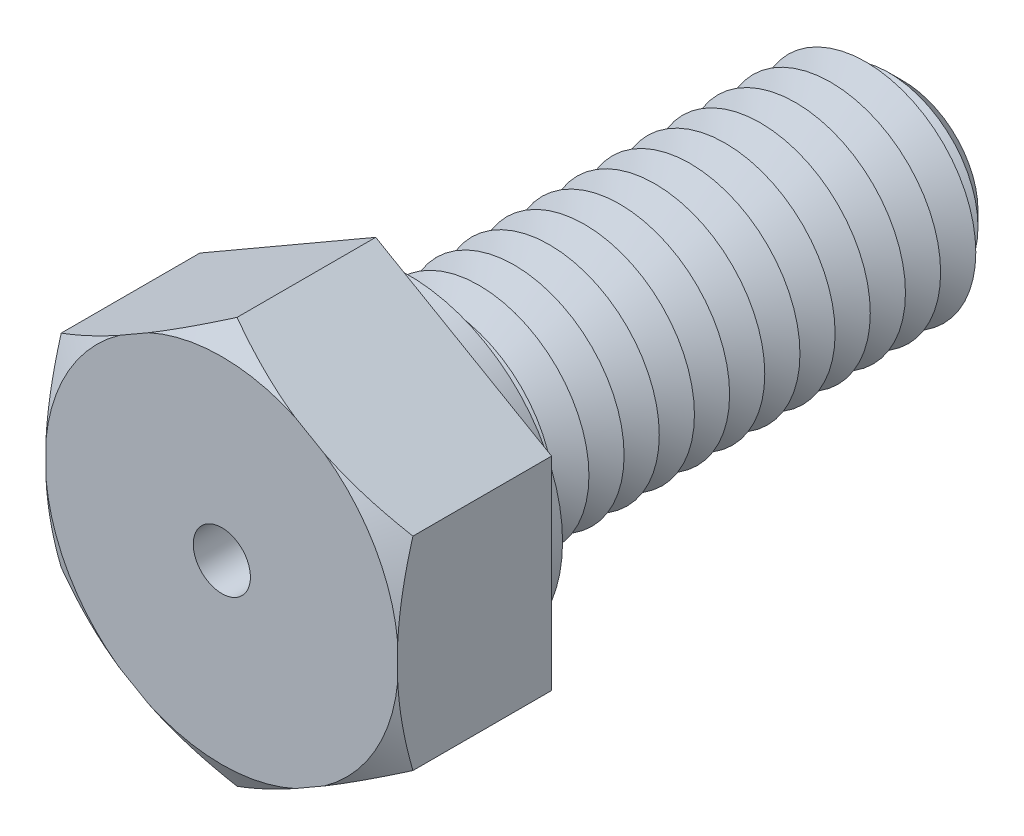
from build123d import *

# Parameters (mm, degrees)
BOSS_EXTRUDE1_DEPTH = 3.5
SKETCH3_R           = 2.5
BOSS_EXTRUDE2_DEPTH = 12
SKETCH4_R           = 3.5
BOSS_EXTRUDE3_DEPTH = 0.75
CHAMFER1_SIZE       = 0.8
LPATTERN1_COUNT     = 14
LPATTERN1_PITCH     = 0.8
SKETCH8_R           = 0.65
CUT_EXTRUDE1_DEPTH  = 15.5


with BuildPart() as part:
    # Sketch2 → Boss-Extrude1 (new body)
    with BuildSketch(Plane.XY):
        Polygon((0, 4.618802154), (-4, 2.309401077), (-4, -2.309401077), (0, -4.618802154), (4, -2.309401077), (4, 2.309401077), align=None)
    extrude(amount=BOSS_EXTRUDE1_DEPTH)

    # Sketch3 → Boss-Extrude2 (add)
    with BuildSketch(Plane(origin=(0, 0, 0), x_dir=(-1, 0, 0), z_dir=(0, 0, -1))):
        Circle(SKETCH3_R)
    extrude(amount=BOSS_EXTRUDE2_DEPTH)

    # Sketch4 → Boss-Extrude3 (add)
    with BuildSketch(Plane(origin=(0, 0, 0), x_dir=(-1, 0, 0), z_dir=(0, 0, -1))):
        with Locations(Location((0, 0, 0), (0, 0, 180))):
            Circle(SKETCH4_R)
    extrude(amount=BOSS_EXTRUDE3_DEPTH)

    # Chamfer1
    chamfer1_edges = [part.edges().sort_by_distance(p)[0] for p in [
        (2.5, 0, -12),
    ]]
    chamfer(chamfer1_edges, length=CHAMFER1_SIZE)

    # Sketch6 → Cut-Revolve1 (revolve, cut)
    with BuildSketch(Plane(origin=(0, 0, 0), x_dir=(0, 0, -1), z_dir=(1, 0, 0)), mode=Mode.PRIVATE) as cut_revolve1_sk:
        Polygon((0.75, 2.5), (1.15, 1.807179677), (1.55, 2.5), align=None)
    cut_revolve1 = revolve(cut_revolve1_sk.sketch.rotate(Axis((0, 0, 3.211670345), (0, 0, -1)), 90), axis=Axis((0, 0, 3.211670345), (0, 0, -1)), mode=Mode.SUBTRACT)

    # LPattern1: Cut-Revolve1 ×14
    with Locations(*[(0, 0, -i * LPATTERN1_PITCH) for i in range(1, LPATTERN1_COUNT)]):
        add(cut_revolve1, mode=Mode.SUBTRACT)

    # Sketch7 → Cut-Revolve2 (revolve, cut)
    with BuildSketch(Plane(origin=(0, 0, 0), x_dir=(0, 0, -1), z_dir=(1, 0, 0)), mode=Mode.PRIVATE) as cut_revolve2_sk:
        Polygon((-3.5, 4.618802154), (-3.5, 4.018802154), (-3.153589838, 4.618802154), align=None)
    revolve(cut_revolve2_sk.sketch.rotate(Axis((0, 0, 3.211670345), (0, 0, -1)), 90), axis=Axis((0, 0, 3.211670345), (0, 0, -1)), mode=Mode.SUBTRACT)

    # Sketch8 → Cut-Extrude1 (cut)
    with BuildSketch(Plane.XY.offset(3.5)):
        Circle(SKETCH8_R)
    extrude(amount=-CUT_EXTRUDE1_DEPTH, mode=Mode.SUBTRACT)


solid = part.part
